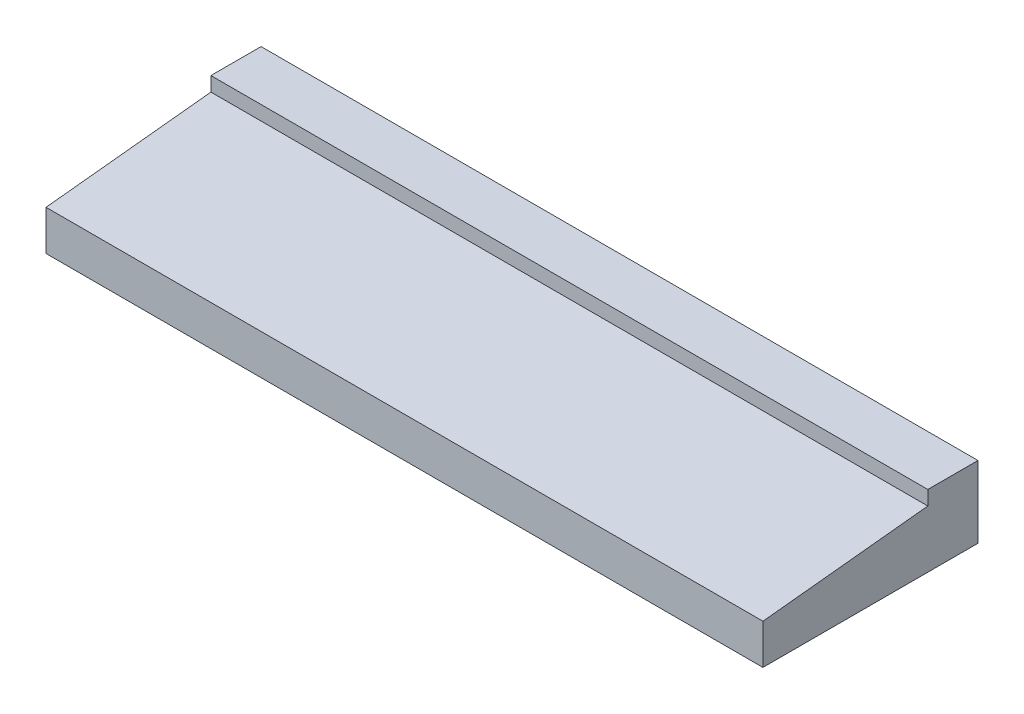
ISO-10303-21;
HEADER;
FILE_DESCRIPTION(('STEP AP214'),'2;1');
FILE_NAME('part.step','',(''),(''),'','','');
FILE_SCHEMA(('AUTOMOTIVE_DESIGN { 1 0 10303 214 1 1 1 1 }'));
ENDSEC;
DATA;
#1=APPLICATION_CONTEXT('core data for automotive mechanical design processes');
#2=APPLICATION_PROTOCOL_DEFINITION('international standard','automotive_design',2000,#1);
#3=PRODUCT_CONTEXT('',#1,'mechanical');
#4=PRODUCT('Part','Part','',(#3));
#5=PRODUCT_RELATED_PRODUCT_CATEGORY('part','',(#4));
#6=PRODUCT_DEFINITION_FORMATION('','',#4);
#7=PRODUCT_DEFINITION_CONTEXT('part definition',#1,'design');
#8=PRODUCT_DEFINITION('design','',#6,#7);
#9=PRODUCT_DEFINITION_SHAPE('','',#8);
#10=(LENGTH_UNIT() NAMED_UNIT(*) SI_UNIT(.MILLI.,.METRE.));
#11=(NAMED_UNIT(*) PLANE_ANGLE_UNIT() SI_UNIT($,.RADIAN.));
#12=(NAMED_UNIT(*) SI_UNIT($,.STERADIAN.) SOLID_ANGLE_UNIT());
#13=UNCERTAINTY_MEASURE_WITH_UNIT(LENGTH_MEASURE(1.E-05),#10,'distance_accuracy_value','');
#14=(GEOMETRIC_REPRESENTATION_CONTEXT(3) GLOBAL_UNCERTAINTY_ASSIGNED_CONTEXT((#13)) GLOBAL_UNIT_ASSIGNED_CONTEXT((#10,
#11,#12)) REPRESENTATION_CONTEXT('',''));
#15=CARTESIAN_POINT('',(0.,0.,0.));
#16=DIRECTION('',(0.,0.,1.));
#17=DIRECTION('',(1.,0.,0.));
#18=AXIS2_PLACEMENT_3D('',#15,#16,#17);
#19=CARTESIAN_POINT('',(100.,0.,-30.));
#20=DIRECTION('',(0.,1.,0.));
#21=DIRECTION('',(0.,0.,1.));
#22=AXIS2_PLACEMENT_3D('',#19,#20,#21);
#23=PLANE('',#22);
#24=DIRECTION('',(0.,0.,-1.));
#25=VECTOR('',#24,1.);
#26=CARTESIAN_POINT('',(0.,0.,-30.));
#27=LINE('',#26,#25);
#28=CARTESIAN_POINT('',(0.,0.,0.));
#29=VERTEX_POINT('',#28);
#30=CARTESIAN_POINT('',(0.,0.,-30.));
#31=VERTEX_POINT('',#30);
#32=EDGE_CURVE('E82',#29,#31,#27,.T.);
#33=ORIENTED_EDGE('',*,*,#32,.T.);
#34=DIRECTION('',(-1.,0.,0.));
#35=VECTOR('',#34,1.);
#36=CARTESIAN_POINT('',(100.,0.,-30.));
#37=LINE('',#36,#35);
#38=CARTESIAN_POINT('',(100.,0.,-30.));
#39=VERTEX_POINT('',#38);
#40=EDGE_CURVE('E11',#39,#31,#37,.T.);
#41=ORIENTED_EDGE('',*,*,#40,.F.);
#42=DIRECTION('',(0.,0.,-1.));
#43=VECTOR('',#42,1.);
#44=CARTESIAN_POINT('',(100.,0.,-30.));
#45=LINE('',#44,#43);
#46=CARTESIAN_POINT('',(100.,0.,0.));
#47=VERTEX_POINT('',#46);
#48=EDGE_CURVE('E105',#47,#39,#45,.T.);
#49=ORIENTED_EDGE('',*,*,#48,.F.);
#50=DIRECTION('',(-1.,0.,0.));
#51=VECTOR('',#50,1.);
#52=CARTESIAN_POINT('',(100.,0.,0.));
#53=LINE('',#52,#51);
#54=EDGE_CURVE('E95',#47,#29,#53,.T.);
#55=ORIENTED_EDGE('',*,*,#54,.T.);
#56=EDGE_LOOP('',(#33,#41,#49,#55));
#57=FACE_BOUND('',#56,.T.);
#58=ADVANCED_FACE('F26',(#57),#23,.F.);
#59=CARTESIAN_POINT('',(100.,10.,-30.));
#60=DIRECTION('',(0.,0.,1.));
#61=DIRECTION('',(1.,0.,0.));
#62=AXIS2_PLACEMENT_3D('',#59,#60,#61);
#63=PLANE('',#62);
#64=DIRECTION('',(0.,1.,0.));
#65=VECTOR('',#64,1.);
#66=CARTESIAN_POINT('',(0.,10.,-30.));
#67=LINE('',#66,#65);
#68=CARTESIAN_POINT('',(0.,10.,-30.));
#69=VERTEX_POINT('',#68);
#70=EDGE_CURVE('E78',#31,#69,#67,.T.);
#71=ORIENTED_EDGE('',*,*,#70,.T.);
#72=DIRECTION('',(-1.,0.,0.));
#73=VECTOR('',#72,1.);
#74=CARTESIAN_POINT('',(100.,10.,-30.));
#75=LINE('',#74,#73);
#76=CARTESIAN_POINT('',(100.,10.,-30.));
#77=VERTEX_POINT('',#76);
#78=EDGE_CURVE('E33',#77,#69,#75,.T.);
#79=ORIENTED_EDGE('',*,*,#78,.F.);
#80=DIRECTION('',(0.,1.,0.));
#81=VECTOR('',#80,1.);
#82=CARTESIAN_POINT('',(100.,10.,-30.));
#83=LINE('',#82,#81);
#84=EDGE_CURVE('E91',#39,#77,#83,.T.);
#85=ORIENTED_EDGE('',*,*,#84,.F.);
#86=ORIENTED_EDGE('',*,*,#40,.T.);
#87=EDGE_LOOP('',(#71,#79,#85,#86));
#88=FACE_BOUND('',#87,.T.);
#89=ADVANCED_FACE('F90',(#88),#63,.F.);
#90=CARTESIAN_POINT('',(100.,10.,-23.));
#91=DIRECTION('',(0.,-1.,0.));
#92=DIRECTION('',(0.,0.,-1.));
#93=AXIS2_PLACEMENT_3D('',#90,#91,#92);
#94=PLANE('',#93);
#95=DIRECTION('',(0.,0.,1.));
#96=VECTOR('',#95,1.);
#97=CARTESIAN_POINT('',(0.,10.,-23.));
#98=LINE('',#97,#96);
#99=CARTESIAN_POINT('',(0.,10.,-23.));
#100=VERTEX_POINT('',#99);
#101=EDGE_CURVE('E84',#69,#100,#98,.T.);
#102=ORIENTED_EDGE('',*,*,#101,.T.);
#103=DIRECTION('',(-1.,0.,0.));
#104=VECTOR('',#103,1.);
#105=CARTESIAN_POINT('',(100.,10.,-23.));
#106=LINE('',#105,#104);
#107=CARTESIAN_POINT('',(100.,10.,-23.));
#108=VERTEX_POINT('',#107);
#109=EDGE_CURVE('E121',#108,#100,#106,.T.);
#110=ORIENTED_EDGE('',*,*,#109,.F.);
#111=DIRECTION('',(0.,0.,1.));
#112=VECTOR('',#111,1.);
#113=CARTESIAN_POINT('',(100.,10.,-23.));
#114=LINE('',#113,#112);
#115=EDGE_CURVE('E108',#77,#108,#114,.T.);
#116=ORIENTED_EDGE('',*,*,#115,.F.);
#117=ORIENTED_EDGE('',*,*,#78,.T.);
#118=EDGE_LOOP('',(#102,#110,#116,#117));
#119=FACE_BOUND('',#118,.T.);
#120=ADVANCED_FACE('F125',(#119),#94,.F.);
#121=CARTESIAN_POINT('',(100.,8.,-23.));
#122=DIRECTION('',(0.,0.,-1.));
#123=DIRECTION('',(-1.,0.,0.));
#124=AXIS2_PLACEMENT_3D('',#121,#122,#123);
#125=PLANE('',#124);
#126=DIRECTION('',(0.,-1.,0.));
#127=VECTOR('',#126,1.);
#128=CARTESIAN_POINT('',(0.,8.,-23.));
#129=LINE('',#128,#127);
#130=CARTESIAN_POINT('',(0.,8.,-23.));
#131=VERTEX_POINT('',#130);
#132=EDGE_CURVE('E99',#100,#131,#129,.T.);
#133=ORIENTED_EDGE('',*,*,#132,.T.);
#134=DIRECTION('',(-1.,0.,0.));
#135=VECTOR('',#134,1.);
#136=CARTESIAN_POINT('',(100.,8.,-23.));
#137=LINE('',#136,#135);
#138=CARTESIAN_POINT('',(100.,8.,-23.));
#139=VERTEX_POINT('',#138);
#140=EDGE_CURVE('E118',#139,#131,#137,.T.);
#141=ORIENTED_EDGE('',*,*,#140,.F.);
#142=DIRECTION('',(0.,-1.,0.));
#143=VECTOR('',#142,1.);
#144=CARTESIAN_POINT('',(100.,8.,-23.));
#145=LINE('',#144,#143);
#146=EDGE_CURVE('E110',#108,#139,#145,.T.);
#147=ORIENTED_EDGE('',*,*,#146,.F.);
#148=ORIENTED_EDGE('',*,*,#109,.T.);
#149=EDGE_LOOP('',(#133,#141,#147,#148));
#150=FACE_BOUND('',#149,.T.);
#151=ADVANCED_FACE('F131',(#150),#125,.F.);
#152=CARTESIAN_POINT('',(100.,8.,-23.));
#153=DIRECTION('',(0.,-0.994521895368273,-0.104528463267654));
#154=DIRECTION('',(0.,0.104528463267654,-0.994521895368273));
#155=AXIS2_PLACEMENT_3D('',#152,#153,#154);
#156=PLANE('',#155);
#157=DIRECTION('',(0.,-0.104528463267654,0.994521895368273));
#158=VECTOR('',#157,1.);
#159=CARTESIAN_POINT('',(0.,8.,-23.));
#160=LINE('',#159,#158);
#161=CARTESIAN_POINT('',(0.,5.58290395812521,-0.00286733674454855));
#162=VERTEX_POINT('',#161);
#163=EDGE_CURVE('E101',#131,#162,#160,.T.);
#164=ORIENTED_EDGE('',*,*,#163,.T.);
#165=DIRECTION('',(-1.,0.,0.));
#166=VECTOR('',#165,1.);
#167=CARTESIAN_POINT('',(100.,5.58290395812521,-0.00286733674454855));
#168=LINE('',#167,#166);
#169=CARTESIAN_POINT('',(100.,5.58290395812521,-0.00286733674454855));
#170=VERTEX_POINT('',#169);
#171=EDGE_CURVE('E115',#170,#162,#168,.T.);
#172=ORIENTED_EDGE('',*,*,#171,.F.);
#173=DIRECTION('',(0.,-0.104528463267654,0.994521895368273));
#174=VECTOR('',#173,1.);
#175=CARTESIAN_POINT('',(100.,8.,-23.));
#176=LINE('',#175,#174);
#177=EDGE_CURVE('E45',#139,#170,#176,.T.);
#178=ORIENTED_EDGE('',*,*,#177,.F.);
#179=ORIENTED_EDGE('',*,*,#140,.T.);
#180=EDGE_LOOP('',(#164,#172,#178,#179));
#181=FACE_BOUND('',#180,.T.);
#182=ADVANCED_FACE('F134',(#181),#156,.F.);
#183=CARTESIAN_POINT('',(100.,0.,0.));
#184=DIRECTION('',(0.,-0.000513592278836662,-0.999999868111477));
#185=DIRECTION('',(0.,0.999999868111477,-0.000513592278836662));
#186=AXIS2_PLACEMENT_3D('',#183,#184,#185);
#187=PLANE('',#186);
#188=DIRECTION('',(0.,-0.999999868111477,0.000513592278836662));
#189=VECTOR('',#188,1.);
#190=CARTESIAN_POINT('',(0.,0.,0.));
#191=LINE('',#190,#189);
#192=EDGE_CURVE('E103',#162,#29,#191,.T.);
#193=ORIENTED_EDGE('',*,*,#192,.T.);
#194=ORIENTED_EDGE('',*,*,#54,.F.);
#195=DIRECTION('',(0.,-0.999999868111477,0.000513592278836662));
#196=VECTOR('',#195,1.);
#197=CARTESIAN_POINT('',(100.,0.,0.));
#198=LINE('',#197,#196);
#199=EDGE_CURVE('E40',#170,#47,#198,.T.);
#200=ORIENTED_EDGE('',*,*,#199,.F.);
#201=ORIENTED_EDGE('',*,*,#171,.T.);
#202=EDGE_LOOP('',(#193,#194,#200,#201));
#203=FACE_BOUND('',#202,.T.);
#204=ADVANCED_FACE('F136',(#203),#187,.F.);
#205=CARTESIAN_POINT('',(100.,0.,-23.));
#206=DIRECTION('',(-1.,0.,0.));
#207=DIRECTION('',(0.,0.,1.));
#208=AXIS2_PLACEMENT_3D('',#205,#206,#207);
#209=PLANE('',#208);
#210=ORIENTED_EDGE('',*,*,#48,.T.);
#211=ORIENTED_EDGE('',*,*,#84,.T.);
#212=ORIENTED_EDGE('',*,*,#115,.T.);
#213=ORIENTED_EDGE('',*,*,#146,.T.);
#214=ORIENTED_EDGE('',*,*,#177,.T.);
#215=ORIENTED_EDGE('',*,*,#199,.T.);
#216=EDGE_LOOP('',(#210,#211,#212,#213,#214,#215));
#217=FACE_BOUND('',#216,.T.);
#218=ADVANCED_FACE('F128',(#217),#209,.F.);
#219=CARTESIAN_POINT('',(0.,0.,-23.));
#220=DIRECTION('',(-1.,0.,0.));
#221=DIRECTION('',(0.,0.,1.));
#222=AXIS2_PLACEMENT_3D('',#219,#220,#221);
#223=PLANE('',#222);
#224=ORIENTED_EDGE('',*,*,#32,.F.);
#225=ORIENTED_EDGE('',*,*,#192,.F.);
#226=ORIENTED_EDGE('',*,*,#163,.F.);
#227=ORIENTED_EDGE('',*,*,#132,.F.);
#228=ORIENTED_EDGE('',*,*,#101,.F.);
#229=ORIENTED_EDGE('',*,*,#70,.F.);
#230=EDGE_LOOP('',(#224,#225,#226,#227,#228,#229));
#231=FACE_BOUND('',#230,.T.);
#232=ADVANCED_FACE('F79',(#231),#223,.T.);
#233=CLOSED_SHELL('',(#58,#89,#120,#151,#182,#204,#218,#232));
#234=MANIFOLD_SOLID_BREP('B2',#233);
#235=ADVANCED_BREP_SHAPE_REPRESENTATION('',(#18,#234),#14);
#236=SHAPE_DEFINITION_REPRESENTATION(#9,#235);
ENDSEC;
END-ISO-10303-21;
